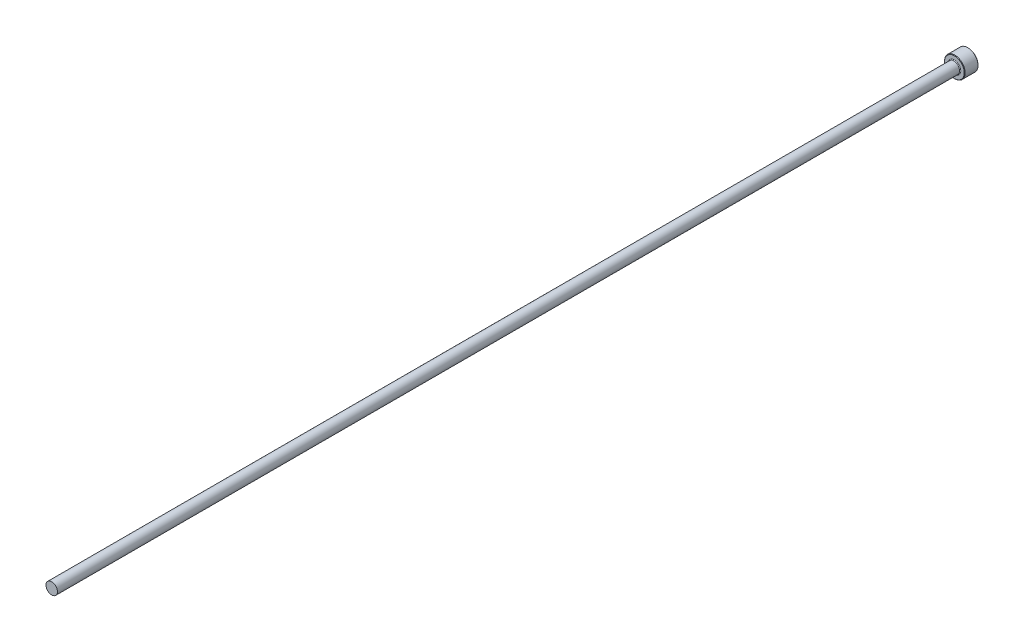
from build123d import *

# Parameters (mm, degrees)
CHAMFER1_SIZE = 0.2


with BuildPart() as part:
    # Sketch1 → Revolve1 (revolve)
    with BuildSketch(Plane(origin=(0, 0, 0), x_dir=(0, 0, -1), z_dir=(1, 0, 0)), mode=Mode.PRIVATE) as revolve1_sk:
        with BuildLine():
            Line((0, 0), (0, 4.5))
            Line((0, 4.5), (-6, 4.5))
            Line((-6, 4.5), (-6, 2.8))
            ThreePointArc((-6, 2.8), (-6.087867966, 2.587867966), (-6.3, 2.5))
            Line((-6.3, 2.5), (-400, 2.5))
            Line((-400, 2.5), (-400, 0))
            Line((-400, 0), (0, 0))
        make_face()
    revolve(revolve1_sk.sketch.rotate(Axis((0, 0, 109.05062828), (0, 0, -1)), 90), axis=Axis((0, 0, 109.05062828), (0, 0, -1)))

    # Chamfer1
    chamfer1_edges = [part.edges().sort_by_distance(p)[0] for p in [
        (-4.5, 0, 0),
        (-4.5, 0, 6),
    ]]
    chamfer(chamfer1_edges, length=CHAMFER1_SIZE)


solid = part.part
